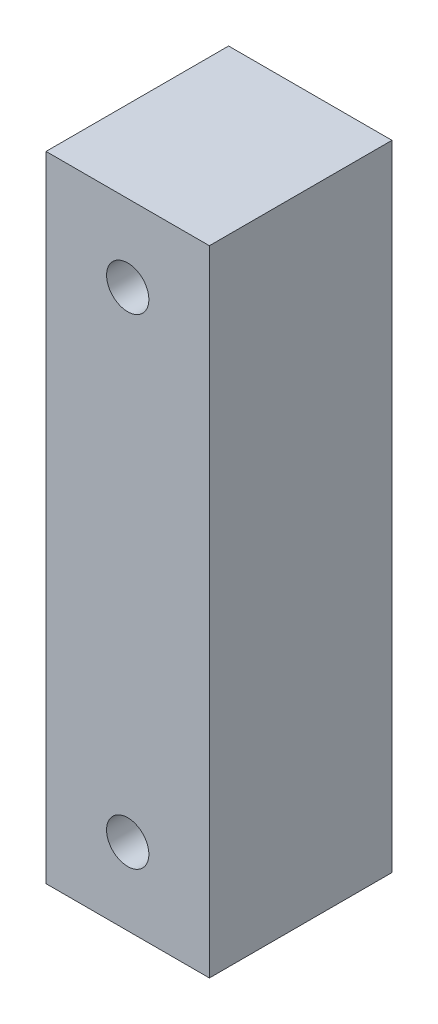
from build123d import *

# Parameters (mm, degrees)
SKETCH1_W           = 330
SKETCH1_H           = 95
BOSS_EXTRUDE1_DEPTH = 85
SKETCH3_R           = 11
CUT_EXTRUDE2_DEPTH  = 150


with BuildPart() as part:
    # Sketch1 → Boss-Extrude1 (new body)
    with BuildSketch(Plane.YZ):
        with Locations((0, -36)):
            Rectangle(SKETCH1_W, SKETCH1_H)
    extrude(amount=BOSS_EXTRUDE1_DEPTH)

    # Sketch3 → Cut-Extrude2 (cut)
    with BuildSketch(Plane.XY.offset(11.5)):
        with Locations((42.5, 125)):
            Circle(SKETCH3_R)
        with Locations(Location((42.5, -125, 0), (0, 0, 270))):
            Circle(SKETCH3_R)
    extrude(amount=-CUT_EXTRUDE2_DEPTH, mode=Mode.SUBTRACT)


solid = part.part
